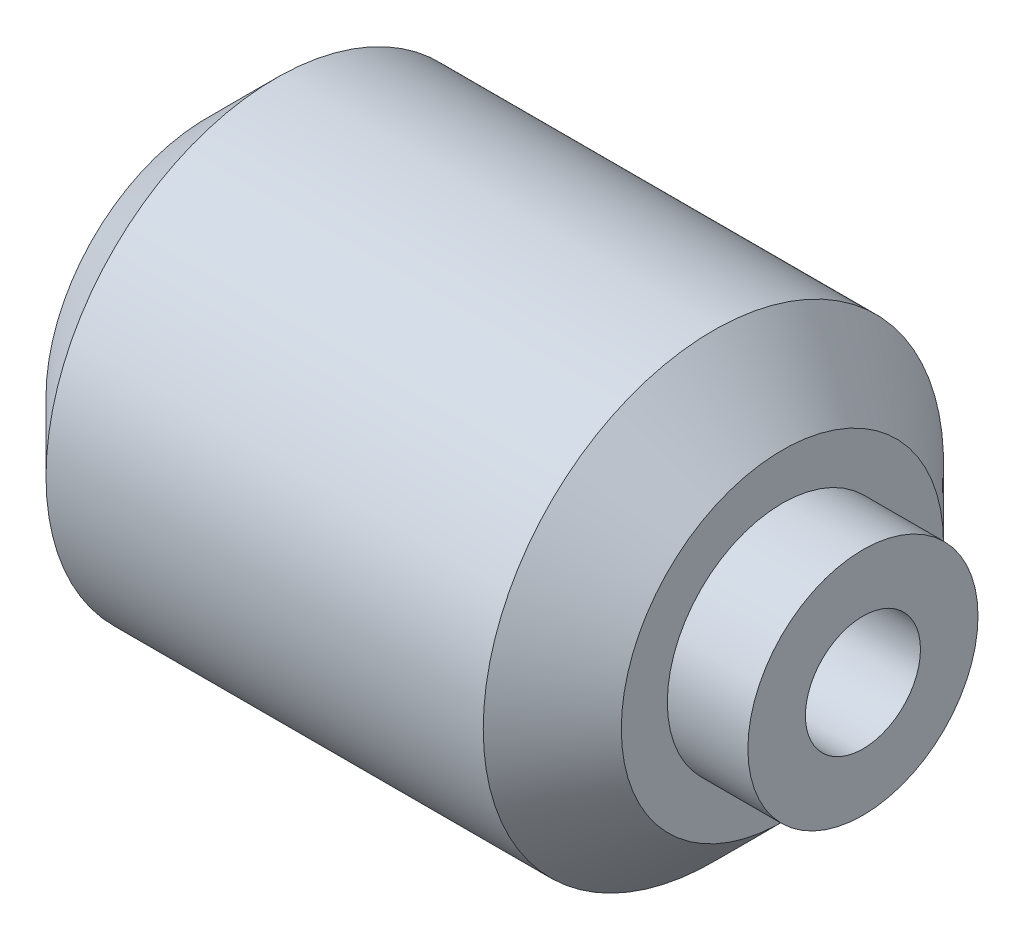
ISO-10303-21;
HEADER;
FILE_DESCRIPTION(('STEP AP214'),'2;1');
FILE_NAME('part.step','',(''),(''),'','','');
FILE_SCHEMA(('AUTOMOTIVE_DESIGN { 1 0 10303 214 1 1 1 1 }'));
ENDSEC;
DATA;
#1=APPLICATION_CONTEXT('core data for automotive mechanical design processes');
#2=APPLICATION_PROTOCOL_DEFINITION('international standard','automotive_design',2000,#1);
#3=PRODUCT_CONTEXT('',#1,'mechanical');
#4=PRODUCT('Part','Part','',(#3));
#5=PRODUCT_RELATED_PRODUCT_CATEGORY('part','',(#4));
#6=PRODUCT_DEFINITION_FORMATION('','',#4);
#7=PRODUCT_DEFINITION_CONTEXT('part definition',#1,'design');
#8=PRODUCT_DEFINITION('design','',#6,#7);
#9=PRODUCT_DEFINITION_SHAPE('','',#8);
#10=(LENGTH_UNIT() NAMED_UNIT(*) SI_UNIT(.MILLI.,.METRE.));
#11=(NAMED_UNIT(*) PLANE_ANGLE_UNIT() SI_UNIT($,.RADIAN.));
#12=(NAMED_UNIT(*) SI_UNIT($,.STERADIAN.) SOLID_ANGLE_UNIT());
#13=UNCERTAINTY_MEASURE_WITH_UNIT(LENGTH_MEASURE(1.E-05),#10,'distance_accuracy_value','');
#14=(GEOMETRIC_REPRESENTATION_CONTEXT(3) GLOBAL_UNCERTAINTY_ASSIGNED_CONTEXT((#13)) GLOBAL_UNIT_ASSIGNED_CONTEXT((#10,
#11,#12)) REPRESENTATION_CONTEXT('',''));
#15=CARTESIAN_POINT('',(0.,0.,0.));
#16=DIRECTION('',(0.,0.,1.));
#17=DIRECTION('',(1.,0.,0.));
#18=AXIS2_PLACEMENT_3D('',#15,#16,#17);
#19=CARTESIAN_POINT('',(0.,0.,0.));
#20=DIRECTION('',(1.,0.,0.));
#21=DIRECTION('',(0.,0.,-1.));
#22=AXIS2_PLACEMENT_3D('',#19,#20,#21);
#23=PLANE('',#22);
#24=CARTESIAN_POINT('',(0.,0.,0.));
#25=DIRECTION('',(1.,0.,0.));
#26=DIRECTION('',(0.,0.,-1.));
#27=AXIS2_PLACEMENT_3D('',#24,#25,#26);
#28=CIRCLE('',#27,2.5);
#29=CARTESIAN_POINT('',(0.,0.,-2.5));
#30=VERTEX_POINT('',#29);
#31=EDGE_CURVE('E55',#30,#30,#28,.T.);
#32=ORIENTED_EDGE('',*,*,#31,.T.);
#33=EDGE_LOOP('',(#32));
#34=FACE_BOUND('',#33,.T.);
#35=CARTESIAN_POINT('',(0.,0.,0.));
#36=DIRECTION('',(-1.,0.,0.));
#37=DIRECTION('',(0.,0.,1.));
#38=AXIS2_PLACEMENT_3D('',#35,#36,#37);
#39=CIRCLE('',#38,7.);
#40=CARTESIAN_POINT('',(0.,0.,7.));
#41=VERTEX_POINT('',#40);
#42=EDGE_CURVE('E10',#41,#41,#39,.T.);
#43=ORIENTED_EDGE('',*,*,#42,.T.);
#44=EDGE_LOOP('',(#43));
#45=FACE_BOUND('',#44,.T.);
#46=ADVANCED_FACE('F30',(#34,#45),#23,.F.);
#47=CARTESIAN_POINT('',(3.,0.,0.));
#48=DIRECTION('',(1.,0.,0.));
#49=DIRECTION('',(0.,0.,-1.));
#50=AXIS2_PLACEMENT_3D('',#47,#48,#49);
#51=CONICAL_SURFACE('',#50,10.,0.785398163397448);
#52=ORIENTED_EDGE('',*,*,#42,.F.);
#53=EDGE_LOOP('',(#52));
#54=FACE_BOUND('',#53,.T.);
#55=CARTESIAN_POINT('',(3.,0.,0.));
#56=DIRECTION('',(-1.,0.,0.));
#57=DIRECTION('',(0.,0.,1.));
#58=AXIS2_PLACEMENT_3D('',#55,#56,#57);
#59=CIRCLE('',#58,10.);
#60=CARTESIAN_POINT('',(3.,0.,10.));
#61=VERTEX_POINT('',#60);
#62=EDGE_CURVE('E36',#61,#61,#59,.T.);
#63=ORIENTED_EDGE('',*,*,#62,.T.);
#64=EDGE_LOOP('',(#63));
#65=FACE_BOUND('',#64,.T.);
#66=ADVANCED_FACE('F83',(#54,#65),#51,.T.);
#67=CARTESIAN_POINT('',(0.,0.,0.));
#68=DIRECTION('',(-1.,0.,0.));
#69=DIRECTION('',(0.,0.,1.));
#70=AXIS2_PLACEMENT_3D('',#67,#68,#69);
#71=CYLINDRICAL_SURFACE('',#70,10.);
#72=ORIENTED_EDGE('',*,*,#62,.F.);
#73=EDGE_LOOP('',(#72));
#74=FACE_BOUND('',#73,.T.);
#75=CARTESIAN_POINT('',(22.,0.,0.));
#76=DIRECTION('',(-1.,0.,0.));
#77=DIRECTION('',(0.,0.,1.));
#78=AXIS2_PLACEMENT_3D('',#75,#76,#77);
#79=CIRCLE('',#78,10.);
#80=CARTESIAN_POINT('',(22.,0.,10.));
#81=VERTEX_POINT('',#80);
#82=EDGE_CURVE('E40',#81,#81,#79,.T.);
#83=ORIENTED_EDGE('',*,*,#82,.T.);
#84=EDGE_LOOP('',(#83));
#85=FACE_BOUND('',#84,.T.);
#86=ADVANCED_FACE('F88',(#74,#85),#71,.T.);
#87=CARTESIAN_POINT('',(25.,0.,0.));
#88=DIRECTION('',(-1.,0.,0.));
#89=DIRECTION('',(0.,0.,1.));
#90=AXIS2_PLACEMENT_3D('',#87,#88,#89);
#91=CONICAL_SURFACE('',#90,7.,0.785398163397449);
#92=ORIENTED_EDGE('',*,*,#82,.F.);
#93=EDGE_LOOP('',(#92));
#94=FACE_BOUND('',#93,.T.);
#95=CARTESIAN_POINT('',(25.,0.,0.));
#96=DIRECTION('',(-1.,0.,0.));
#97=DIRECTION('',(0.,0.,1.));
#98=AXIS2_PLACEMENT_3D('',#95,#96,#97);
#99=CIRCLE('',#98,7.);
#100=CARTESIAN_POINT('',(25.,0.,7.));
#101=VERTEX_POINT('',#100);
#102=EDGE_CURVE('E44',#101,#101,#99,.T.);
#103=ORIENTED_EDGE('',*,*,#102,.T.);
#104=EDGE_LOOP('',(#103));
#105=FACE_BOUND('',#104,.T.);
#106=ADVANCED_FACE('F78',(#94,#105),#91,.T.);
#107=CARTESIAN_POINT('',(25.,0.,-7.));
#108=DIRECTION('',(-1.,0.,0.));
#109=DIRECTION('',(0.,0.,1.));
#110=AXIS2_PLACEMENT_3D('',#107,#108,#109);
#111=PLANE('',#110);
#112=ORIENTED_EDGE('',*,*,#102,.F.);
#113=EDGE_LOOP('',(#112));
#114=FACE_BOUND('',#113,.T.);
#115=CARTESIAN_POINT('',(25.,0.,0.));
#116=DIRECTION('',(-1.,0.,0.));
#117=DIRECTION('',(0.,0.,1.));
#118=AXIS2_PLACEMENT_3D('',#115,#116,#117);
#119=CIRCLE('',#118,5.);
#120=CARTESIAN_POINT('',(25.,0.,5.));
#121=VERTEX_POINT('',#120);
#122=EDGE_CURVE('E49',#121,#121,#119,.T.);
#123=ORIENTED_EDGE('',*,*,#122,.T.);
#124=EDGE_LOOP('',(#123));
#125=FACE_BOUND('',#124,.T.);
#126=ADVANCED_FACE('F72',(#114,#125),#111,.F.);
#127=CARTESIAN_POINT('',(0.,0.,0.));
#128=DIRECTION('',(-1.,0.,0.));
#129=DIRECTION('',(0.,0.,1.));
#130=AXIS2_PLACEMENT_3D('',#127,#128,#129);
#131=CYLINDRICAL_SURFACE('',#130,5.);
#132=ORIENTED_EDGE('',*,*,#122,.F.);
#133=EDGE_LOOP('',(#132));
#134=FACE_BOUND('',#133,.T.);
#135=CARTESIAN_POINT('',(28.5,0.,0.));
#136=DIRECTION('',(-1.,0.,0.));
#137=DIRECTION('',(0.,0.,1.));
#138=AXIS2_PLACEMENT_3D('',#135,#136,#137);
#139=CIRCLE('',#138,5.);
#140=CARTESIAN_POINT('',(28.5,0.,5.));
#141=VERTEX_POINT('',#140);
#142=EDGE_CURVE('E52',#141,#141,#139,.T.);
#143=ORIENTED_EDGE('',*,*,#142,.T.);
#144=EDGE_LOOP('',(#143));
#145=FACE_BOUND('',#144,.T.);
#146=ADVANCED_FACE('F67',(#134,#145),#131,.T.);
#147=CARTESIAN_POINT('',(28.5,0.,-5.));
#148=DIRECTION('',(-1.,0.,0.));
#149=DIRECTION('',(0.,0.,1.));
#150=AXIS2_PLACEMENT_3D('',#147,#148,#149);
#151=PLANE('',#150);
#152=CARTESIAN_POINT('',(28.5,0.,0.));
#153=DIRECTION('',(1.,0.,0.));
#154=DIRECTION('',(0.,0.,-1.));
#155=AXIS2_PLACEMENT_3D('',#152,#153,#154);
#156=CIRCLE('',#155,2.5);
#157=CARTESIAN_POINT('',(28.5,0.,-2.5));
#158=VERTEX_POINT('',#157);
#159=EDGE_CURVE('E58',#158,#158,#156,.T.);
#160=ORIENTED_EDGE('',*,*,#159,.F.);
#161=EDGE_LOOP('',(#160));
#162=FACE_BOUND('',#161,.T.);
#163=ORIENTED_EDGE('',*,*,#142,.F.);
#164=EDGE_LOOP('',(#163));
#165=FACE_BOUND('',#164,.T.);
#166=ADVANCED_FACE('F64',(#162,#165),#151,.F.);
#167=CARTESIAN_POINT('',(0.,0.,0.));
#168=DIRECTION('',(1.,0.,0.));
#169=DIRECTION('',(0.,0.,-1.));
#170=AXIS2_PLACEMENT_3D('',#167,#168,#169);
#171=CYLINDRICAL_SURFACE('',#170,2.5);
#172=ORIENTED_EDGE('',*,*,#31,.F.);
#173=EDGE_LOOP('',(#172));
#174=FACE_BOUND('',#173,.T.);
#175=ORIENTED_EDGE('',*,*,#159,.T.);
#176=EDGE_LOOP('',(#175));
#177=FACE_BOUND('',#176,.T.);
#178=ADVANCED_FACE('F62',(#174,#177),#171,.F.);
#179=CLOSED_SHELL('',(#46,#66,#86,#106,#126,#146,#166,#178));
#180=MANIFOLD_SOLID_BREP('B2',#179);
#181=ADVANCED_BREP_SHAPE_REPRESENTATION('',(#18,#180),#14);
#182=SHAPE_DEFINITION_REPRESENTATION(#9,#181);
ENDSEC;
END-ISO-10303-21;
